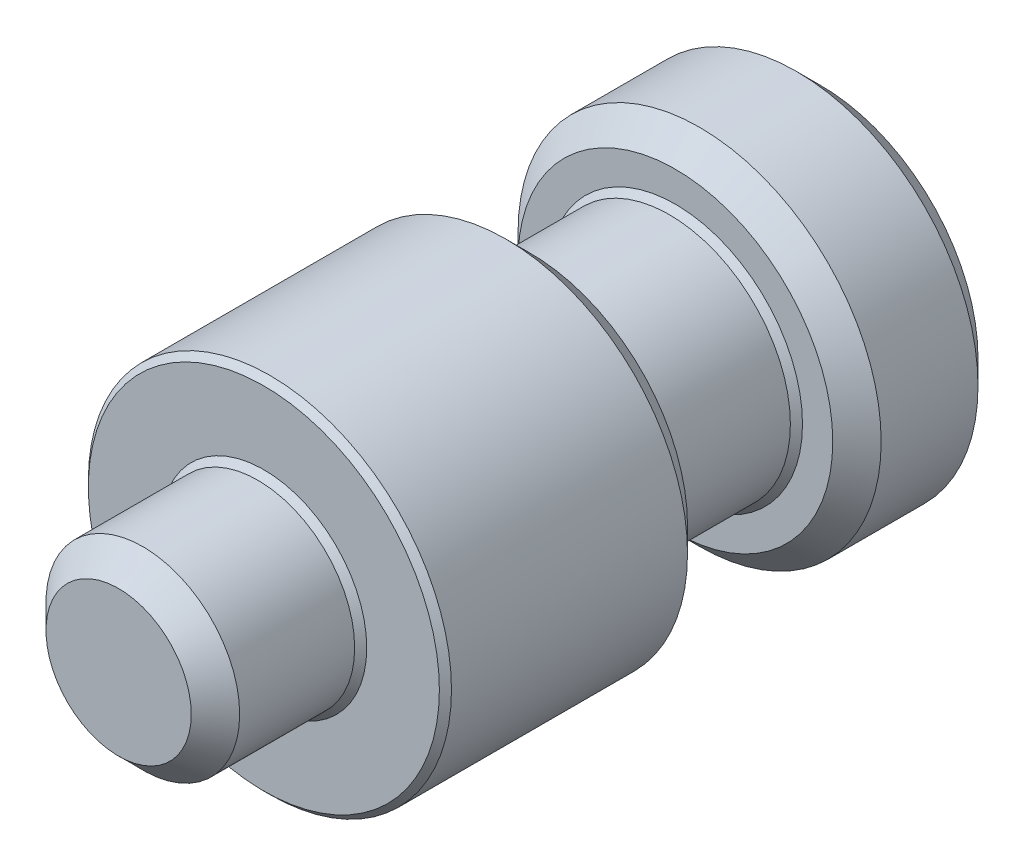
ISO-10303-21;
HEADER;
FILE_DESCRIPTION(('STEP AP214'),'2;1');
FILE_NAME('part.step','',(''),(''),'','','');
FILE_SCHEMA(('AUTOMOTIVE_DESIGN { 1 0 10303 214 1 1 1 1 }'));
ENDSEC;
DATA;
#1=APPLICATION_CONTEXT('core data for automotive mechanical design processes');
#2=APPLICATION_PROTOCOL_DEFINITION('international standard','automotive_design',2000,#1);
#3=PRODUCT_CONTEXT('',#1,'mechanical');
#4=PRODUCT('Part','Part','',(#3));
#5=PRODUCT_RELATED_PRODUCT_CATEGORY('part','',(#4));
#6=PRODUCT_DEFINITION_FORMATION('','',#4);
#7=PRODUCT_DEFINITION_CONTEXT('part definition',#1,'design');
#8=PRODUCT_DEFINITION('design','',#6,#7);
#9=PRODUCT_DEFINITION_SHAPE('','',#8);
#10=(LENGTH_UNIT() NAMED_UNIT(*) SI_UNIT(.MILLI.,.METRE.));
#11=(NAMED_UNIT(*) PLANE_ANGLE_UNIT() SI_UNIT($,.RADIAN.));
#12=(NAMED_UNIT(*) SI_UNIT($,.STERADIAN.) SOLID_ANGLE_UNIT());
#13=UNCERTAINTY_MEASURE_WITH_UNIT(LENGTH_MEASURE(1.E-05),#10,'distance_accuracy_value','');
#14=(GEOMETRIC_REPRESENTATION_CONTEXT(3) GLOBAL_UNCERTAINTY_ASSIGNED_CONTEXT((#13)) GLOBAL_UNIT_ASSIGNED_CONTEXT((#10,
#11,#12)) REPRESENTATION_CONTEXT('',''));
#15=CARTESIAN_POINT('',(0.,0.,0.));
#16=DIRECTION('',(0.,0.,1.));
#17=DIRECTION('',(1.,0.,0.));
#18=AXIS2_PLACEMENT_3D('',#15,#16,#17);
#19=CARTESIAN_POINT('',(0.,0.,23.));
#20=DIRECTION('',(0.,0.,1.));
#21=DIRECTION('',(1.,0.,0.));
#22=AXIS2_PLACEMENT_3D('',#19,#20,#21);
#23=PLANE('',#22);
#24=CARTESIAN_POINT('',(0.,0.,23.));
#25=DIRECTION('',(0.,0.,1.));
#26=DIRECTION('',(1.,0.,0.));
#27=AXIS2_PLACEMENT_3D('',#24,#25,#26);
#28=CIRCLE('',#27,4.25);
#29=CARTESIAN_POINT('',(4.25,0.,23.));
#30=VERTEX_POINT('',#29);
#31=EDGE_CURVE('E51',#30,#30,#28,.F.);
#32=ORIENTED_EDGE('',*,*,#31,.T.);
#33=EDGE_LOOP('',(#32));
#34=FACE_BOUND('',#33,.T.);
#35=CARTESIAN_POINT('',(0.,0.,23.));
#36=DIRECTION('',(0.,0.,1.));
#37=DIRECTION('',(1.,0.,0.));
#38=AXIS2_PLACEMENT_3D('',#35,#36,#37);
#39=CIRCLE('',#38,7.25);
#40=CARTESIAN_POINT('',(7.25,0.,23.));
#41=VERTEX_POINT('',#40);
#42=EDGE_CURVE('E54',#41,#41,#39,.T.);
#43=ORIENTED_EDGE('',*,*,#42,.T.);
#44=EDGE_LOOP('',(#43));
#45=FACE_BOUND('',#44,.T.);
#46=ADVANCED_FACE('F28',(#34,#45),#23,.T.);
#47=CARTESIAN_POINT('',(0.,0.,6.));
#48=DIRECTION('',(0.,0.,1.));
#49=DIRECTION('',(1.,0.,0.));
#50=AXIS2_PLACEMENT_3D('',#47,#48,#49);
#51=PLANE('',#50);
#52=CARTESIAN_POINT('',(0.,0.,6.));
#53=DIRECTION('',(0.,0.,1.));
#54=DIRECTION('',(1.,0.,0.));
#55=AXIS2_PLACEMENT_3D('',#52,#53,#54);
#56=CIRCLE('',#55,5.25);
#57=CARTESIAN_POINT('',(5.25,0.,6.));
#58=VERTEX_POINT('',#57);
#59=EDGE_CURVE('E35',#58,#58,#56,.F.);
#60=ORIENTED_EDGE('',*,*,#59,.T.);
#61=EDGE_LOOP('',(#60));
#62=FACE_BOUND('',#61,.T.);
#63=CARTESIAN_POINT('',(0.,0.,6.));
#64=DIRECTION('',(0.,0.,1.));
#65=DIRECTION('',(1.,0.,0.));
#66=AXIS2_PLACEMENT_3D('',#63,#64,#65);
#67=CIRCLE('',#66,6.49999999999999);
#68=CARTESIAN_POINT('',(6.49999999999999,0.,6.));
#69=VERTEX_POINT('',#68);
#70=EDGE_CURVE('E69',#69,#69,#67,.T.);
#71=ORIENTED_EDGE('',*,*,#70,.T.);
#72=EDGE_LOOP('',(#71));
#73=FACE_BOUND('',#72,.T.);
#74=ADVANCED_FACE('F104',(#62,#73),#51,.T.);
#75=CARTESIAN_POINT('',(0.,0.,6.));
#76=DIRECTION('',(0.,0.,-1.));
#77=DIRECTION('',(-1.,0.,0.));
#78=AXIS2_PLACEMENT_3D('',#75,#76,#77);
#79=CYLINDRICAL_SURFACE('',#78,7.5);
#80=CARTESIAN_POINT('',(0.,0.,4.99999999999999));
#81=DIRECTION('',(0.,0.,1.));
#82=DIRECTION('',(1.,0.,0.));
#83=AXIS2_PLACEMENT_3D('',#80,#81,#82);
#84=CIRCLE('',#83,7.5);
#85=CARTESIAN_POINT('',(7.5,0.,4.99999999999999));
#86=VERTEX_POINT('',#85);
#87=EDGE_CURVE('E63',#86,#86,#84,.F.);
#88=ORIENTED_EDGE('',*,*,#87,.T.);
#89=EDGE_LOOP('',(#88));
#90=FACE_BOUND('',#89,.T.);
#91=CARTESIAN_POINT('',(0.,0.,1.));
#92=DIRECTION('',(0.,0.,1.));
#93=DIRECTION('',(1.,0.,0.));
#94=AXIS2_PLACEMENT_3D('',#91,#92,#93);
#95=CIRCLE('',#94,7.5);
#96=CARTESIAN_POINT('',(7.5,0.,1.));
#97=VERTEX_POINT('',#96);
#98=EDGE_CURVE('E66',#97,#97,#95,.T.);
#99=ORIENTED_EDGE('',*,*,#98,.T.);
#100=EDGE_LOOP('',(#99));
#101=FACE_BOUND('',#100,.T.);
#102=ADVANCED_FACE('F110',(#90,#101),#79,.T.);
#103=CARTESIAN_POINT('',(0.,0.,0.));
#104=DIRECTION('',(0.,0.,1.));
#105=DIRECTION('',(1.,0.,0.));
#106=AXIS2_PLACEMENT_3D('',#103,#104,#105);
#107=PLANE('',#106);
#108=CARTESIAN_POINT('',(0.,0.,0.));
#109=DIRECTION('',(0.,0.,1.));
#110=DIRECTION('',(1.,0.,0.));
#111=AXIS2_PLACEMENT_3D('',#108,#109,#110);
#112=CIRCLE('',#111,6.49999999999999);
#113=CARTESIAN_POINT('',(6.49999999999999,0.,0.));
#114=VERTEX_POINT('',#113);
#115=EDGE_CURVE('E60',#114,#114,#112,.F.);
#116=ORIENTED_EDGE('',*,*,#115,.T.);
#117=EDGE_LOOP('',(#116));
#118=FACE_BOUND('',#117,.T.);
#119=ADVANCED_FACE('F124',(#118),#107,.F.);
#120=CARTESIAN_POINT('',(0.,0.,12.));
#121=DIRECTION('',(0.,0.,-1.));
#122=DIRECTION('',(-1.,0.,0.));
#123=AXIS2_PLACEMENT_3D('',#120,#121,#122);
#124=CYLINDRICAL_SURFACE('',#123,5.);
#125=CARTESIAN_POINT('',(0.,0.,6.25));
#126=DIRECTION('',(0.,0.,1.));
#127=DIRECTION('',(1.,0.,0.));
#128=AXIS2_PLACEMENT_3D('',#125,#126,#127);
#129=CIRCLE('',#128,5.);
#130=CARTESIAN_POINT('',(5.,0.,6.25));
#131=VERTEX_POINT('',#130);
#132=EDGE_CURVE('E39',#131,#131,#129,.T.);
#133=ORIENTED_EDGE('',*,*,#132,.T.);
#134=EDGE_LOOP('',(#133));
#135=FACE_BOUND('',#134,.T.);
#136=CARTESIAN_POINT('',(0.,0.,11.75));
#137=DIRECTION('',(0.,0.,1.));
#138=DIRECTION('',(1.,0.,0.));
#139=AXIS2_PLACEMENT_3D('',#136,#137,#138);
#140=CIRCLE('',#139,5.);
#141=CARTESIAN_POINT('',(5.,0.,11.75));
#142=VERTEX_POINT('',#141);
#143=EDGE_CURVE('E43',#142,#142,#140,.F.);
#144=ORIENTED_EDGE('',*,*,#143,.T.);
#145=EDGE_LOOP('',(#144));
#146=FACE_BOUND('',#145,.T.);
#147=ADVANCED_FACE('F119',(#135,#146),#124,.T.);
#148=CARTESIAN_POINT('',(0.,0.,12.));
#149=DIRECTION('',(0.,0.,1.));
#150=DIRECTION('',(1.,0.,0.));
#151=AXIS2_PLACEMENT_3D('',#148,#149,#150);
#152=PLANE('',#151);
#153=CARTESIAN_POINT('',(0.,0.,12.));
#154=DIRECTION('',(0.,0.,1.));
#155=DIRECTION('',(1.,0.,0.));
#156=AXIS2_PLACEMENT_3D('',#153,#154,#155);
#157=CIRCLE('',#156,5.25);
#158=CARTESIAN_POINT('',(5.25,0.,12.));
#159=VERTEX_POINT('',#158);
#160=EDGE_CURVE('E10',#159,#159,#157,.T.);
#161=ORIENTED_EDGE('',*,*,#160,.T.);
#162=EDGE_LOOP('',(#161));
#163=FACE_BOUND('',#162,.T.);
#164=CARTESIAN_POINT('',(0.,0.,12.));
#165=DIRECTION('',(0.,0.,1.));
#166=DIRECTION('',(1.,0.,0.));
#167=AXIS2_PLACEMENT_3D('',#164,#165,#166);
#168=CIRCLE('',#167,6.5);
#169=CARTESIAN_POINT('',(6.5,0.,12.));
#170=VERTEX_POINT('',#169);
#171=EDGE_CURVE('E72',#170,#170,#168,.F.);
#172=ORIENTED_EDGE('',*,*,#171,.T.);
#173=EDGE_LOOP('',(#172));
#174=FACE_BOUND('',#173,.T.);
#175=ADVANCED_FACE('F115',(#163,#174),#152,.F.);
#176=CARTESIAN_POINT('',(0.,0.,23.));
#177=DIRECTION('',(0.,0.,-1.));
#178=DIRECTION('',(-1.,0.,0.));
#179=AXIS2_PLACEMENT_3D('',#176,#177,#178);
#180=CYLINDRICAL_SURFACE('',#179,7.5);
#181=CARTESIAN_POINT('',(0.,0.,22.75));
#182=DIRECTION('',(0.,0.,1.));
#183=DIRECTION('',(1.,0.,0.));
#184=AXIS2_PLACEMENT_3D('',#181,#182,#183);
#185=CIRCLE('',#184,7.5);
#186=CARTESIAN_POINT('',(7.5,0.,22.75));
#187=VERTEX_POINT('',#186);
#188=EDGE_CURVE('E48',#187,#187,#185,.F.);
#189=ORIENTED_EDGE('',*,*,#188,.T.);
#190=EDGE_LOOP('',(#189));
#191=FACE_BOUND('',#190,.T.);
#192=CARTESIAN_POINT('',(0.,0.,13.));
#193=DIRECTION('',(0.,0.,1.));
#194=DIRECTION('',(1.,0.,0.));
#195=AXIS2_PLACEMENT_3D('',#192,#193,#194);
#196=CIRCLE('',#195,7.5);
#197=CARTESIAN_POINT('',(7.5,0.,13.));
#198=VERTEX_POINT('',#197);
#199=EDGE_CURVE('E75',#198,#198,#196,.T.);
#200=ORIENTED_EDGE('',*,*,#199,.T.);
#201=EDGE_LOOP('',(#200));
#202=FACE_BOUND('',#201,.T.);
#203=ADVANCED_FACE('F118',(#191,#202),#180,.T.);
#204=CARTESIAN_POINT('',(0.,0.,29.));
#205=DIRECTION('',(0.,0.,-1.));
#206=DIRECTION('',(-1.,0.,0.));
#207=AXIS2_PLACEMENT_3D('',#204,#205,#206);
#208=CYLINDRICAL_SURFACE('',#207,4.);
#209=CARTESIAN_POINT('',(0.,0.,23.25));
#210=DIRECTION('',(0.,0.,1.));
#211=DIRECTION('',(1.,0.,0.));
#212=AXIS2_PLACEMENT_3D('',#209,#210,#211);
#213=CIRCLE('',#212,4.);
#214=CARTESIAN_POINT('',(4.,0.,23.25));
#215=VERTEX_POINT('',#214);
#216=EDGE_CURVE('E57',#215,#215,#213,.T.);
#217=ORIENTED_EDGE('',*,*,#216,.T.);
#218=EDGE_LOOP('',(#217));
#219=FACE_BOUND('',#218,.T.);
#220=CARTESIAN_POINT('',(0.,0.,28.));
#221=DIRECTION('',(0.,0.,1.));
#222=DIRECTION('',(1.,0.,0.));
#223=AXIS2_PLACEMENT_3D('',#220,#221,#222);
#224=CIRCLE('',#223,4.);
#225=CARTESIAN_POINT('',(4.,0.,28.));
#226=VERTEX_POINT('',#225);
#227=EDGE_CURVE('E78',#226,#226,#224,.F.);
#228=ORIENTED_EDGE('',*,*,#227,.T.);
#229=EDGE_LOOP('',(#228));
#230=FACE_BOUND('',#229,.T.);
#231=ADVANCED_FACE('F99',(#219,#230),#208,.T.);
#232=CARTESIAN_POINT('',(0.,0.,29.));
#233=DIRECTION('',(0.,0.,1.));
#234=DIRECTION('',(1.,0.,0.));
#235=AXIS2_PLACEMENT_3D('',#232,#233,#234);
#236=PLANE('',#235);
#237=CARTESIAN_POINT('',(0.,0.,29.));
#238=DIRECTION('',(0.,0.,1.));
#239=DIRECTION('',(1.,0.,0.));
#240=AXIS2_PLACEMENT_3D('',#237,#238,#239);
#241=CIRCLE('',#240,3.);
#242=CARTESIAN_POINT('',(3.,0.,29.));
#243=VERTEX_POINT('',#242);
#244=EDGE_CURVE('E81',#243,#243,#241,.T.);
#245=ORIENTED_EDGE('',*,*,#244,.T.);
#246=EDGE_LOOP('',(#245));
#247=FACE_BOUND('',#246,.T.);
#248=ADVANCED_FACE('F85',(#247),#236,.T.);
#249=CARTESIAN_POINT('',(0.,0.,29.));
#250=DIRECTION('',(0.,0.,-1.));
#251=DIRECTION('',(-1.,0.,0.));
#252=AXIS2_PLACEMENT_3D('',#249,#250,#251);
#253=CONICAL_SURFACE('',#252,3.,0.785398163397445);
#254=ORIENTED_EDGE('',*,*,#227,.F.);
#255=EDGE_LOOP('',(#254));
#256=FACE_BOUND('',#255,.T.);
#257=ORIENTED_EDGE('',*,*,#244,.F.);
#258=EDGE_LOOP('',(#257));
#259=FACE_BOUND('',#258,.T.);
#260=ADVANCED_FACE('F87',(#256,#259),#253,.T.);
#261=CARTESIAN_POINT('',(0.,0.,13.));
#262=DIRECTION('',(0.,0.,1.));
#263=DIRECTION('',(1.,0.,0.));
#264=AXIS2_PLACEMENT_3D('',#261,#262,#263);
#265=CONICAL_SURFACE('',#264,7.5,0.78539816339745);
#266=ORIENTED_EDGE('',*,*,#171,.F.);
#267=EDGE_LOOP('',(#266));
#268=FACE_BOUND('',#267,.T.);
#269=ORIENTED_EDGE('',*,*,#199,.F.);
#270=EDGE_LOOP('',(#269));
#271=FACE_BOUND('',#270,.T.);
#272=ADVANCED_FACE('F89',(#268,#271),#265,.T.);
#273=CARTESIAN_POINT('',(0.,0.,6.));
#274=DIRECTION('',(0.,0.,-1.));
#275=DIRECTION('',(-1.,0.,0.));
#276=AXIS2_PLACEMENT_3D('',#273,#274,#275);
#277=CONICAL_SURFACE('',#276,6.49999999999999,0.785398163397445);
#278=ORIENTED_EDGE('',*,*,#87,.F.);
#279=EDGE_LOOP('',(#278));
#280=FACE_BOUND('',#279,.T.);
#281=ORIENTED_EDGE('',*,*,#70,.F.);
#282=EDGE_LOOP('',(#281));
#283=FACE_BOUND('',#282,.T.);
#284=ADVANCED_FACE('F96',(#280,#283),#277,.T.);
#285=CARTESIAN_POINT('',(0.,0.,1.));
#286=DIRECTION('',(0.,0.,1.));
#287=DIRECTION('',(1.,0.,0.));
#288=AXIS2_PLACEMENT_3D('',#285,#286,#287);
#289=CONICAL_SURFACE('',#288,7.5,0.78539816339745);
#290=ORIENTED_EDGE('',*,*,#115,.F.);
#291=EDGE_LOOP('',(#290));
#292=FACE_BOUND('',#291,.T.);
#293=ORIENTED_EDGE('',*,*,#98,.F.);
#294=EDGE_LOOP('',(#293));
#295=FACE_BOUND('',#294,.T.);
#296=ADVANCED_FACE('F137',(#292,#295),#289,.T.);
#297=CARTESIAN_POINT('',(0.,0.,23.25));
#298=DIRECTION('',(0.,0.,-1.));
#299=DIRECTION('',(-1.,0.,0.));
#300=AXIS2_PLACEMENT_3D('',#297,#298,#299);
#301=CONICAL_SURFACE('',#300,4.,0.785398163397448);
#302=ORIENTED_EDGE('',*,*,#31,.F.);
#303=EDGE_LOOP('',(#302));
#304=FACE_BOUND('',#303,.T.);
#305=ORIENTED_EDGE('',*,*,#216,.F.);
#306=EDGE_LOOP('',(#305));
#307=FACE_BOUND('',#306,.T.);
#308=ADVANCED_FACE('F139',(#304,#307),#301,.T.);
#309=CARTESIAN_POINT('',(0.,0.,23.));
#310=DIRECTION('',(0.,0.,-1.));
#311=DIRECTION('',(-1.,0.,0.));
#312=AXIS2_PLACEMENT_3D('',#309,#310,#311);
#313=CONICAL_SURFACE('',#312,7.25,0.785398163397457);
#314=ORIENTED_EDGE('',*,*,#188,.F.);
#315=EDGE_LOOP('',(#314));
#316=FACE_BOUND('',#315,.T.);
#317=ORIENTED_EDGE('',*,*,#42,.F.);
#318=EDGE_LOOP('',(#317));
#319=FACE_BOUND('',#318,.T.);
#320=ADVANCED_FACE('F146',(#316,#319),#313,.T.);
#321=CARTESIAN_POINT('',(0.,0.,6.25));
#322=DIRECTION('',(0.,0.,-1.));
#323=DIRECTION('',(-1.,0.,0.));
#324=AXIS2_PLACEMENT_3D('',#321,#322,#323);
#325=CONICAL_SURFACE('',#324,5.,0.785398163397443);
#326=ORIENTED_EDGE('',*,*,#59,.F.);
#327=EDGE_LOOP('',(#326));
#328=FACE_BOUND('',#327,.T.);
#329=ORIENTED_EDGE('',*,*,#132,.F.);
#330=EDGE_LOOP('',(#329));
#331=FACE_BOUND('',#330,.T.);
#332=ADVANCED_FACE('F154',(#328,#331),#325,.T.);
#333=CARTESIAN_POINT('',(0.,0.,12.));
#334=DIRECTION('',(0.,0.,1.));
#335=DIRECTION('',(1.,0.,0.));
#336=AXIS2_PLACEMENT_3D('',#333,#334,#335);
#337=CONICAL_SURFACE('',#336,5.25,0.785398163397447);
#338=ORIENTED_EDGE('',*,*,#143,.F.);
#339=EDGE_LOOP('',(#338));
#340=FACE_BOUND('',#339,.T.);
#341=ORIENTED_EDGE('',*,*,#160,.F.);
#342=EDGE_LOOP('',(#341));
#343=FACE_BOUND('',#342,.T.);
#344=ADVANCED_FACE('F30',(#340,#343),#337,.T.);
#345=CLOSED_SHELL('',(#46,#74,#102,#119,#147,#175,#203,#231,#248,#260,#272,#284,#296,#308,#320,
#332,#344));
#346=MANIFOLD_SOLID_BREP('B2',#345);
#347=ADVANCED_BREP_SHAPE_REPRESENTATION('',(#18,#346),#14);
#348=SHAPE_DEFINITION_REPRESENTATION(#9,#347);
ENDSEC;
END-ISO-10303-21;
